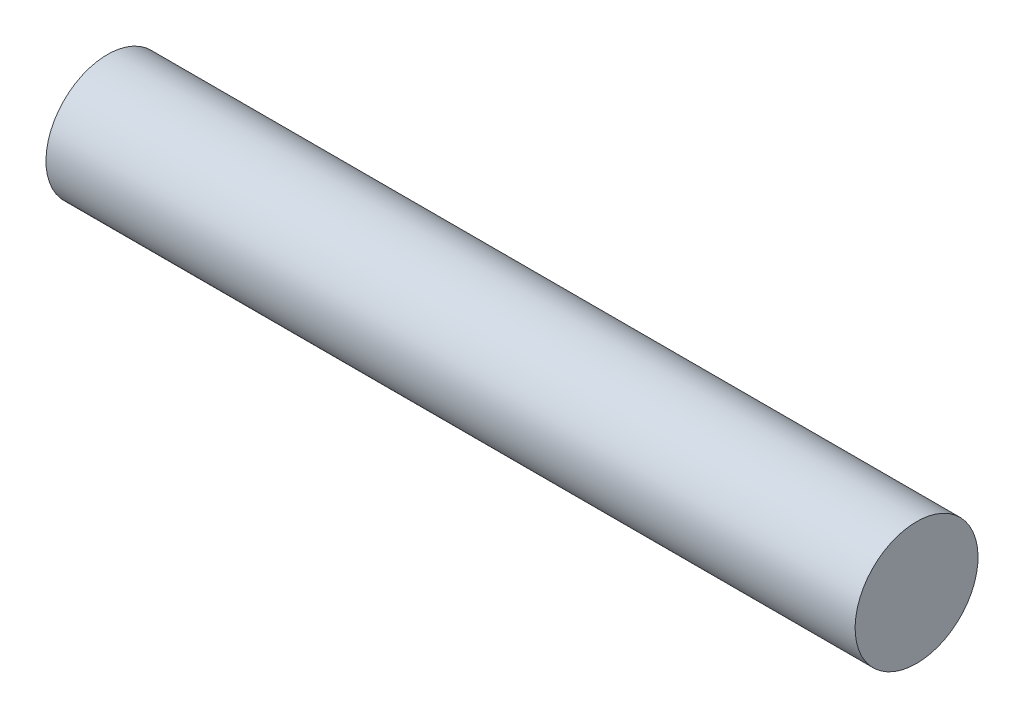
from build123d import *

# Parameters (mm, degrees)
SKETCH1_W = 106.9975
SKETCH1_H = 8.128


with BuildPart() as part:
    # Sketch1 → Revolve1 (revolve)
    with BuildSketch(Plane.XY, mode=Mode.PRIVATE) as revolve1_sk:
        with Locations((53.49875, 4.064)):
            Rectangle(SKETCH1_W, SKETCH1_H)
    revolve(revolve1_sk.sketch.rotate(Axis((106.9975, 0, 0), (-1, 0, 0)), 180), axis=Axis((106.9975, 0, 0), (-1, 0, 0)))


solid = part.part
